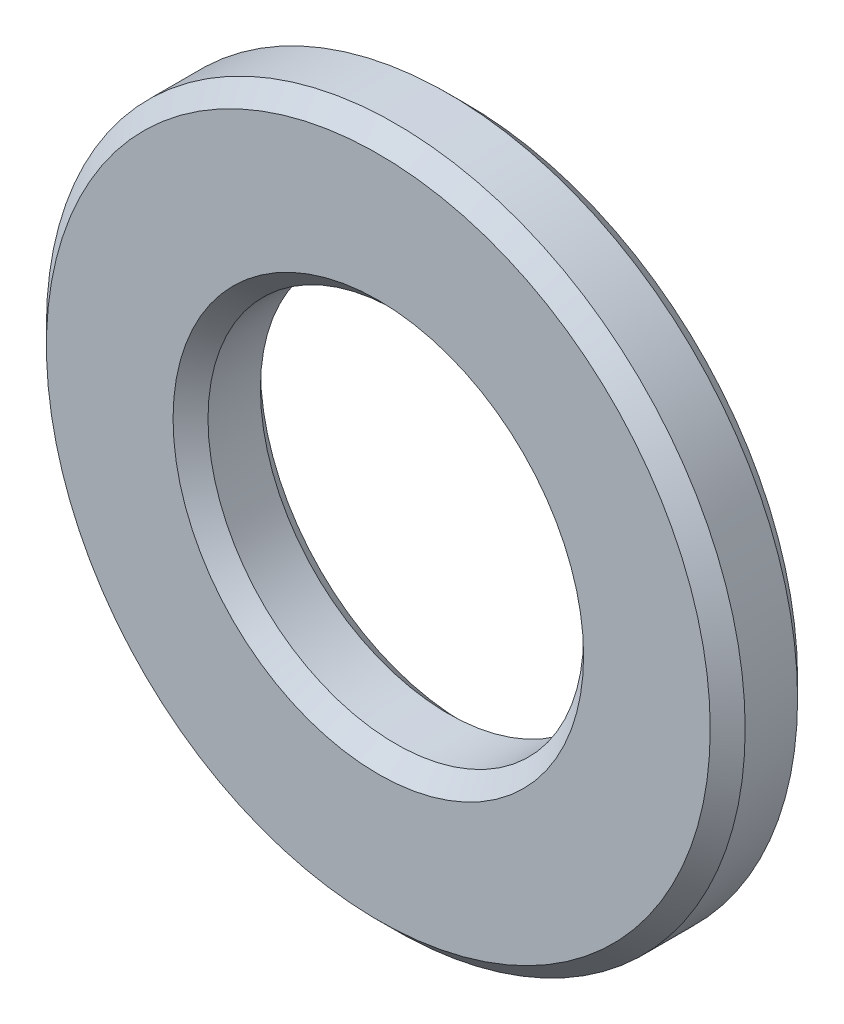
ISO-10303-21;
HEADER;
FILE_DESCRIPTION(('STEP AP214'),'2;1');
FILE_NAME('part.step','',(''),(''),'','','');
FILE_SCHEMA(('AUTOMOTIVE_DESIGN { 1 0 10303 214 1 1 1 1 }'));
ENDSEC;
DATA;
#1=APPLICATION_CONTEXT('core data for automotive mechanical design processes');
#2=APPLICATION_PROTOCOL_DEFINITION('international standard','automotive_design',2000,#1);
#3=PRODUCT_CONTEXT('',#1,'mechanical');
#4=PRODUCT('Part','Part','',(#3));
#5=PRODUCT_RELATED_PRODUCT_CATEGORY('part','',(#4));
#6=PRODUCT_DEFINITION_FORMATION('','',#4);
#7=PRODUCT_DEFINITION_CONTEXT('part definition',#1,'design');
#8=PRODUCT_DEFINITION('design','',#6,#7);
#9=PRODUCT_DEFINITION_SHAPE('','',#8);
#10=(LENGTH_UNIT() NAMED_UNIT(*) SI_UNIT(.MILLI.,.METRE.));
#11=(NAMED_UNIT(*) PLANE_ANGLE_UNIT() SI_UNIT($,.RADIAN.));
#12=(NAMED_UNIT(*) SI_UNIT($,.STERADIAN.) SOLID_ANGLE_UNIT());
#13=UNCERTAINTY_MEASURE_WITH_UNIT(LENGTH_MEASURE(1.E-05),#10,'distance_accuracy_value','');
#14=(GEOMETRIC_REPRESENTATION_CONTEXT(3) GLOBAL_UNCERTAINTY_ASSIGNED_CONTEXT((#13)) GLOBAL_UNIT_ASSIGNED_CONTEXT((#10,
#11,#12)) REPRESENTATION_CONTEXT('',''));
#15=CARTESIAN_POINT('',(0.,0.,0.));
#16=DIRECTION('',(0.,0.,1.));
#17=DIRECTION('',(1.,0.,0.));
#18=AXIS2_PLACEMENT_3D('',#15,#16,#17);
#19=CARTESIAN_POINT('',(0.,0.,0.5));
#20=DIRECTION('',(0.,0.,1.));
#21=DIRECTION('',(1.,0.,0.));
#22=AXIS2_PLACEMENT_3D('',#19,#20,#21);
#23=PLANE('',#22);
#24=CARTESIAN_POINT('',(0.,0.,0.5));
#25=DIRECTION('',(0.,0.,1.));
#26=DIRECTION('',(1.,0.,0.));
#27=AXIS2_PLACEMENT_3D('',#24,#25,#26);
#28=CIRCLE('',#27,2.35);
#29=CARTESIAN_POINT('',(2.35,0.,0.5));
#30=VERTEX_POINT('',#29);
#31=EDGE_CURVE('E10',#30,#30,#28,.F.);
#32=ORIENTED_EDGE('',*,*,#31,.T.);
#33=EDGE_LOOP('',(#32));
#34=FACE_BOUND('',#33,.T.);
#35=CARTESIAN_POINT('',(0.,0.,0.5));
#36=DIRECTION('',(0.,0.,1.));
#37=DIRECTION('',(1.,0.,0.));
#38=AXIS2_PLACEMENT_3D('',#35,#36,#37);
#39=CIRCLE('',#38,3.8);
#40=CARTESIAN_POINT('',(3.8,0.,0.5));
#41=VERTEX_POINT('',#40);
#42=EDGE_CURVE('E45',#41,#41,#39,.T.);
#43=ORIENTED_EDGE('',*,*,#42,.T.);
#44=EDGE_LOOP('',(#43));
#45=FACE_BOUND('',#44,.T.);
#46=ADVANCED_FACE('F37',(#34,#45),#23,.T.);
#47=CARTESIAN_POINT('',(0.,0.,-0.5));
#48=DIRECTION('',(0.,0.,1.));
#49=DIRECTION('',(1.,0.,0.));
#50=AXIS2_PLACEMENT_3D('',#47,#48,#49);
#51=PLANE('',#50);
#52=CARTESIAN_POINT('',(0.,0.,-0.5));
#53=DIRECTION('',(0.,0.,1.));
#54=DIRECTION('',(1.,0.,0.));
#55=AXIS2_PLACEMENT_3D('',#52,#53,#54);
#56=CIRCLE('',#55,3.8);
#57=CARTESIAN_POINT('',(3.8,0.,-0.5));
#58=VERTEX_POINT('',#57);
#59=EDGE_CURVE('E64',#58,#58,#56,.F.);
#60=ORIENTED_EDGE('',*,*,#59,.T.);
#61=EDGE_LOOP('',(#60));
#62=FACE_BOUND('',#61,.T.);
#63=CARTESIAN_POINT('',(0.,0.,-0.5));
#64=DIRECTION('',(0.,0.,1.));
#65=DIRECTION('',(1.,0.,0.));
#66=AXIS2_PLACEMENT_3D('',#63,#64,#65);
#67=CIRCLE('',#66,2.35);
#68=CARTESIAN_POINT('',(-2.35,0.,-0.5));
#69=VERTEX_POINT('',#68);
#70=EDGE_CURVE('E67',#69,#69,#67,.T.);
#71=ORIENTED_EDGE('',*,*,#70,.T.);
#72=EDGE_LOOP('',(#71));
#73=FACE_BOUND('',#72,.T.);
#74=ADVANCED_FACE('F89',(#62,#73),#51,.F.);
#75=CARTESIAN_POINT('',(0.,0.,0.5));
#76=DIRECTION('',(0.,0.,-1.));
#77=DIRECTION('',(-1.,0.,0.));
#78=AXIS2_PLACEMENT_3D('',#75,#76,#77);
#79=CYLINDRICAL_SURFACE('',#78,4.);
#80=CARTESIAN_POINT('',(0.,0.,-0.3));
#81=DIRECTION('',(0.,0.,1.));
#82=DIRECTION('',(1.,0.,0.));
#83=AXIS2_PLACEMENT_3D('',#80,#81,#82);
#84=CIRCLE('',#83,4.);
#85=CARTESIAN_POINT('',(4.,0.,-0.3));
#86=VERTEX_POINT('',#85);
#87=EDGE_CURVE('E70',#86,#86,#84,.T.);
#88=ORIENTED_EDGE('',*,*,#87,.T.);
#89=EDGE_LOOP('',(#88));
#90=FACE_BOUND('',#89,.T.);
#91=CARTESIAN_POINT('',(0.,0.,0.300000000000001));
#92=DIRECTION('',(0.,0.,1.));
#93=DIRECTION('',(1.,0.,0.));
#94=AXIS2_PLACEMENT_3D('',#91,#92,#93);
#95=CIRCLE('',#94,4.);
#96=CARTESIAN_POINT('',(4.,0.,0.300000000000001));
#97=VERTEX_POINT('',#96);
#98=EDGE_CURVE('E74',#97,#97,#95,.F.);
#99=ORIENTED_EDGE('',*,*,#98,.T.);
#100=EDGE_LOOP('',(#99));
#101=FACE_BOUND('',#100,.T.);
#102=ADVANCED_FACE('F78',(#90,#101),#79,.T.);
#103=CARTESIAN_POINT('',(0.,0.,0.5));
#104=DIRECTION('',(0.,0.,-1.));
#105=DIRECTION('',(-1.,0.,0.));
#106=AXIS2_PLACEMENT_3D('',#103,#104,#105);
#107=CYLINDRICAL_SURFACE('',#106,2.15);
#108=CARTESIAN_POINT('',(0.,0.,-0.300000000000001));
#109=DIRECTION('',(0.,0.,1.));
#110=DIRECTION('',(1.,0.,0.));
#111=AXIS2_PLACEMENT_3D('',#108,#109,#110);
#112=CIRCLE('',#111,2.15);
#113=CARTESIAN_POINT('',(-2.15,0.,-0.300000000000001));
#114=VERTEX_POINT('',#113);
#115=EDGE_CURVE('E52',#114,#114,#112,.F.);
#116=ORIENTED_EDGE('',*,*,#115,.T.);
#117=EDGE_LOOP('',(#116));
#118=FACE_BOUND('',#117,.T.);
#119=CARTESIAN_POINT('',(0.,0.,0.300000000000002));
#120=DIRECTION('',(0.,0.,1.));
#121=DIRECTION('',(1.,0.,0.));
#122=AXIS2_PLACEMENT_3D('',#119,#120,#121);
#123=CIRCLE('',#122,2.15);
#124=CARTESIAN_POINT('',(2.15,0.,0.300000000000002));
#125=VERTEX_POINT('',#124);
#126=EDGE_CURVE('E58',#125,#125,#123,.T.);
#127=ORIENTED_EDGE('',*,*,#126,.T.);
#128=EDGE_LOOP('',(#127));
#129=FACE_BOUND('',#128,.T.);
#130=ADVANCED_FACE('F97',(#118,#129),#107,.F.);
#131=CARTESIAN_POINT('',(0.,0.,-0.3));
#132=DIRECTION('',(0.,0.,1.));
#133=DIRECTION('',(1.,0.,0.));
#134=AXIS2_PLACEMENT_3D('',#131,#132,#133);
#135=CONICAL_SURFACE('',#134,4.,0.785398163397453);
#136=CARTESIAN_POINT('',(3.8,0.,-0.5));
#137=CARTESIAN_POINT('',(3.80208333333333,0.,-0.497916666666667));
#138=CARTESIAN_POINT('',(3.80416666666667,0.,-0.495833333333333));
#139=CARTESIAN_POINT('',(3.80833333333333,0.,-0.491666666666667));
#140=CARTESIAN_POINT('',(3.81041666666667,0.,-0.489583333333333));
#141=CARTESIAN_POINT('',(3.81458333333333,0.,-0.485416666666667));
#142=CARTESIAN_POINT('',(3.81666666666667,0.,-0.483333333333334));
#143=CARTESIAN_POINT('',(3.82083333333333,0.,-0.479166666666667));
#144=CARTESIAN_POINT('',(3.82291666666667,0.,-0.477083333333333));
#145=CARTESIAN_POINT('',(3.82708333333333,0.,-0.472916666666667));
#146=CARTESIAN_POINT('',(3.82916666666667,0.,-0.470833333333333));
#147=CARTESIAN_POINT('',(3.83333333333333,0.,-0.466666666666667));
#148=CARTESIAN_POINT('',(3.83541666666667,0.,-0.464583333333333));
#149=CARTESIAN_POINT('',(3.83958333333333,0.,-0.460416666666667));
#150=CARTESIAN_POINT('',(3.84166666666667,0.,-0.458333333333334));
#151=CARTESIAN_POINT('',(3.84583333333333,0.,-0.454166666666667));
#152=CARTESIAN_POINT('',(3.84791666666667,0.,-0.452083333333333));
#153=CARTESIAN_POINT('',(3.85208333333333,0.,-0.447916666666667));
#154=CARTESIAN_POINT('',(3.85416666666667,0.,-0.445833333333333));
#155=CARTESIAN_POINT('',(3.85833333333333,0.,-0.441666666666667));
#156=CARTESIAN_POINT('',(3.86041666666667,0.,-0.439583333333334));
#157=CARTESIAN_POINT('',(3.86458333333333,0.,-0.435416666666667));
#158=CARTESIAN_POINT('',(3.86666666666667,0.,-0.433333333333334));
#159=CARTESIAN_POINT('',(3.87083333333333,0.,-0.429166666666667));
#160=CARTESIAN_POINT('',(3.87291666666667,0.,-0.427083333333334));
#161=CARTESIAN_POINT('',(3.87708333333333,0.,-0.422916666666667));
#162=CARTESIAN_POINT('',(3.87916666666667,0.,-0.420833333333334));
#163=CARTESIAN_POINT('',(3.88333333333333,0.,-0.416666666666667));
#164=CARTESIAN_POINT('',(3.88541666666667,0.,-0.414583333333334));
#165=CARTESIAN_POINT('',(3.88958333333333,0.,-0.410416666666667));
#166=CARTESIAN_POINT('',(3.89166666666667,0.,-0.408333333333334));
#167=CARTESIAN_POINT('',(3.89583333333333,0.,-0.404166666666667));
#168=CARTESIAN_POINT('',(3.89791666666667,0.,-0.402083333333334));
#169=CARTESIAN_POINT('',(3.90208333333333,0.,-0.397916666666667));
#170=CARTESIAN_POINT('',(3.90416666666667,0.,-0.395833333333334));
#171=CARTESIAN_POINT('',(3.90833333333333,0.,-0.391666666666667));
#172=CARTESIAN_POINT('',(3.91041666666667,0.,-0.389583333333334));
#173=CARTESIAN_POINT('',(3.91458333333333,0.,-0.385416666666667));
#174=CARTESIAN_POINT('',(3.91666666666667,0.,-0.383333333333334));
#175=CARTESIAN_POINT('',(3.92083333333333,0.,-0.379166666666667));
#176=CARTESIAN_POINT('',(3.92291666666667,0.,-0.377083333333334));
#177=CARTESIAN_POINT('',(3.92708333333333,0.,-0.372916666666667));
#178=CARTESIAN_POINT('',(3.92916666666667,0.,-0.370833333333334));
#179=CARTESIAN_POINT('',(3.93333333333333,0.,-0.366666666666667));
#180=CARTESIAN_POINT('',(3.93541666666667,0.,-0.364583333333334));
#181=CARTESIAN_POINT('',(3.93958333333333,0.,-0.360416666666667));
#182=CARTESIAN_POINT('',(3.94166666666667,0.,-0.358333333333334));
#183=CARTESIAN_POINT('',(3.94583333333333,0.,-0.354166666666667));
#184=CARTESIAN_POINT('',(3.94791666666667,0.,-0.352083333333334));
#185=CARTESIAN_POINT('',(3.95208333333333,0.,-0.347916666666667));
#186=CARTESIAN_POINT('',(3.95416666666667,0.,-0.345833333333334));
#187=CARTESIAN_POINT('',(3.95833333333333,0.,-0.341666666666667));
#188=CARTESIAN_POINT('',(3.96041666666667,0.,-0.339583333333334));
#189=CARTESIAN_POINT('',(3.96458333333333,0.,-0.335416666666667));
#190=CARTESIAN_POINT('',(3.96666666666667,0.,-0.333333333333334));
#191=CARTESIAN_POINT('',(3.97083333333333,0.,-0.329166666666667));
#192=CARTESIAN_POINT('',(3.97291666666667,0.,-0.327083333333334));
#193=CARTESIAN_POINT('',(3.97708333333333,0.,-0.322916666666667));
#194=CARTESIAN_POINT('',(3.97916666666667,0.,-0.320833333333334));
#195=CARTESIAN_POINT('',(3.98333333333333,0.,-0.316666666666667));
#196=CARTESIAN_POINT('',(3.98541666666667,0.,-0.314583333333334));
#197=CARTESIAN_POINT('',(3.98958333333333,0.,-0.310416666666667));
#198=CARTESIAN_POINT('',(3.99166666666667,0.,-0.308333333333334));
#199=CARTESIAN_POINT('',(3.99583333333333,0.,-0.304166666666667));
#200=CARTESIAN_POINT('',(3.99791666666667,0.,-0.302083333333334));
#201=CARTESIAN_POINT('',(4.,0.,-0.3));
#202=B_SPLINE_CURVE_WITH_KNOTS('',3,(#136,#137,#138,#139,#140,#141,#142,#143,#144,#145,#146,
#147,#148,#149,#150,#151,#152,#153,#154,#155,#156,#157,#158,#159,#160,#161,#162,#163,#164,#165,
#166,#167,#168,#169,#170,#171,#172,#173,#174,#175,#176,#177,#178,#179,#180,#181,#182,#183,#184,
#185,#186,#187,#188,#189,#190,#191,#192,#193,#194,#195,#196,#197,#198,#199,#200,#201),
.UNSPECIFIED.,.F.,.F.,(4,2,2,2,2,2,2,2,2,2,2,2,2,2,2,2,2,2,2,2,2,2,2,2,2,2,2,2,2,2,2,2,4),(0.,
0.00883883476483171,0.0176776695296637,0.0265165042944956,0.0353553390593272,0.0441941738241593,
0.0530330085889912,0.0618718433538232,0.0707106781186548,0.0795495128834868,0.0883883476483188,
0.0972271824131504,0.106066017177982,0.114904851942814,0.123743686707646,0.132582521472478,
0.14142135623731,0.150260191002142,0.159099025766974,0.167937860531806,0.176776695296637,
0.185615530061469,0.194454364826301,0.203293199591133,0.212132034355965,0.220970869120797,
0.229809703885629,0.238648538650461,0.247487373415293,0.256326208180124,0.265165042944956,
0.274003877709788,0.28284271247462),.UNSPECIFIED.);
#203=EDGE_CURVE('BSEAM102',#58,#86,#202,.T.);
#204=ORIENTED_EDGE('',*,*,#59,.F.);
#205=ORIENTED_EDGE('',*,*,#87,.F.);
#206=ORIENTED_EDGE('',*,*,#203,.T.);
#207=ORIENTED_EDGE('',*,*,#203,.F.);
#208=EDGE_LOOP('',(#204,#206,#205,#207));
#209=FACE_BOUND('',#208,.T.);
#210=ADVANCED_FACE('F102',(#209),#135,.T.);
#211=CARTESIAN_POINT('',(0.,0.,-0.5));
#212=DIRECTION('',(0.,0.,-1.));
#213=DIRECTION('',(-1.,0.,0.));
#214=AXIS2_PLACEMENT_3D('',#211,#212,#213);
#215=CONICAL_SURFACE('',#214,2.35,0.785398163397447);
#216=CARTESIAN_POINT('',(-2.15,0.,-0.300000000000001));
#217=CARTESIAN_POINT('',(-2.15208333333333,0.,-0.302083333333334));
#218=CARTESIAN_POINT('',(-2.15416666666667,0.,-0.304166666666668));
#219=CARTESIAN_POINT('',(-2.15833333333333,0.,-0.308333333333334));
#220=CARTESIAN_POINT('',(-2.16041666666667,0.,-0.310416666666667));
#221=CARTESIAN_POINT('',(-2.16458333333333,0.,-0.314583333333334));
#222=CARTESIAN_POINT('',(-2.16666666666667,0.,-0.316666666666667));
#223=CARTESIAN_POINT('',(-2.17083333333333,0.,-0.320833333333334));
#224=CARTESIAN_POINT('',(-2.17291666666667,0.,-0.322916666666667));
#225=CARTESIAN_POINT('',(-2.17708333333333,0.,-0.327083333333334));
#226=CARTESIAN_POINT('',(-2.17916666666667,0.,-0.329166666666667));
#227=CARTESIAN_POINT('',(-2.18333333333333,0.,-0.333333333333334));
#228=CARTESIAN_POINT('',(-2.18541666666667,0.,-0.335416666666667));
#229=CARTESIAN_POINT('',(-2.18958333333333,0.,-0.339583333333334));
#230=CARTESIAN_POINT('',(-2.19166666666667,0.,-0.341666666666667));
#231=CARTESIAN_POINT('',(-2.19583333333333,0.,-0.345833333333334));
#232=CARTESIAN_POINT('',(-2.19791666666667,0.,-0.347916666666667));
#233=CARTESIAN_POINT('',(-2.20208333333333,0.,-0.352083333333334));
#234=CARTESIAN_POINT('',(-2.20416666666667,0.,-0.354166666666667));
#235=CARTESIAN_POINT('',(-2.20833333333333,0.,-0.358333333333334));
#236=CARTESIAN_POINT('',(-2.21041666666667,0.,-0.360416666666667));
#237=CARTESIAN_POINT('',(-2.21458333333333,0.,-0.364583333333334));
#238=CARTESIAN_POINT('',(-2.21666666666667,0.,-0.366666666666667));
#239=CARTESIAN_POINT('',(-2.22083333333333,0.,-0.370833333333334));
#240=CARTESIAN_POINT('',(-2.22291666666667,0.,-0.372916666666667));
#241=CARTESIAN_POINT('',(-2.22708333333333,0.,-0.377083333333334));
#242=CARTESIAN_POINT('',(-2.22916666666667,0.,-0.379166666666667));
#243=CARTESIAN_POINT('',(-2.23333333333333,0.,-0.383333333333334));
#244=CARTESIAN_POINT('',(-2.23541666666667,0.,-0.385416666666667));
#245=CARTESIAN_POINT('',(-2.23958333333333,0.,-0.389583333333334));
#246=CARTESIAN_POINT('',(-2.24166666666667,0.,-0.391666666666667));
#247=CARTESIAN_POINT('',(-2.24583333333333,0.,-0.395833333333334));
#248=CARTESIAN_POINT('',(-2.24791666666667,0.,-0.397916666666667));
#249=CARTESIAN_POINT('',(-2.25208333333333,0.,-0.402083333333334));
#250=CARTESIAN_POINT('',(-2.25416666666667,0.,-0.404166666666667));
#251=CARTESIAN_POINT('',(-2.25833333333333,0.,-0.408333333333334));
#252=CARTESIAN_POINT('',(-2.26041666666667,0.,-0.410416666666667));
#253=CARTESIAN_POINT('',(-2.26458333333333,0.,-0.414583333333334));
#254=CARTESIAN_POINT('',(-2.26666666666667,0.,-0.416666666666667));
#255=CARTESIAN_POINT('',(-2.27083333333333,0.,-0.420833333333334));
#256=CARTESIAN_POINT('',(-2.27291666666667,0.,-0.422916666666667));
#257=CARTESIAN_POINT('',(-2.27708333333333,0.,-0.427083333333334));
#258=CARTESIAN_POINT('',(-2.27916666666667,0.,-0.429166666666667));
#259=CARTESIAN_POINT('',(-2.28333333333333,0.,-0.433333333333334));
#260=CARTESIAN_POINT('',(-2.28541666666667,0.,-0.435416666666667));
#261=CARTESIAN_POINT('',(-2.28958333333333,0.,-0.439583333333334));
#262=CARTESIAN_POINT('',(-2.29166666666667,0.,-0.441666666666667));
#263=CARTESIAN_POINT('',(-2.29583333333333,0.,-0.445833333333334));
#264=CARTESIAN_POINT('',(-2.29791666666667,0.,-0.447916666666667));
#265=CARTESIAN_POINT('',(-2.30208333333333,0.,-0.452083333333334));
#266=CARTESIAN_POINT('',(-2.30416666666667,0.,-0.454166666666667));
#267=CARTESIAN_POINT('',(-2.30833333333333,0.,-0.458333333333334));
#268=CARTESIAN_POINT('',(-2.31041666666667,0.,-0.460416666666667));
#269=CARTESIAN_POINT('',(-2.31458333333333,0.,-0.464583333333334));
#270=CARTESIAN_POINT('',(-2.31666666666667,0.,-0.466666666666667));
#271=CARTESIAN_POINT('',(-2.32083333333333,0.,-0.470833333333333));
#272=CARTESIAN_POINT('',(-2.32291666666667,0.,-0.472916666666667));
#273=CARTESIAN_POINT('',(-2.32708333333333,0.,-0.477083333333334));
#274=CARTESIAN_POINT('',(-2.32916666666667,0.,-0.479166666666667));
#275=CARTESIAN_POINT('',(-2.33333333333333,0.,-0.483333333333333));
#276=CARTESIAN_POINT('',(-2.33541666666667,0.,-0.485416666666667));
#277=CARTESIAN_POINT('',(-2.33958333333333,0.,-0.489583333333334));
#278=CARTESIAN_POINT('',(-2.34166666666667,0.,-0.491666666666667));
#279=CARTESIAN_POINT('',(-2.34583333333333,0.,-0.495833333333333));
#280=CARTESIAN_POINT('',(-2.34791666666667,0.,-0.497916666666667));
#281=CARTESIAN_POINT('',(-2.35,0.,-0.5));
#282=B_SPLINE_CURVE_WITH_KNOTS('',3,(#216,#217,#218,#219,#220,#221,#222,#223,#224,#225,#226,
#227,#228,#229,#230,#231,#232,#233,#234,#235,#236,#237,#238,#239,#240,#241,#242,#243,#244,#245,
#246,#247,#248,#249,#250,#251,#252,#253,#254,#255,#256,#257,#258,#259,#260,#261,#262,#263,#264,
#265,#266,#267,#268,#269,#270,#271,#272,#273,#274,#275,#276,#277,#278,#279,#280,#281),
.UNSPECIFIED.,.F.,.F.,(4,2,2,2,2,2,2,2,2,2,2,2,2,2,2,2,2,2,2,2,2,2,2,2,2,2,2,2,2,2,2,2,4),(0.,
0.00883883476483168,0.0176776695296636,0.0265165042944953,0.0353553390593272,0.0441941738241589,
0.0530330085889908,0.0618718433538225,0.0707106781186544,0.0795495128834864,0.0883883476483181,
0.0972271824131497,0.106066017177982,0.114904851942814,0.123743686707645,0.132582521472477,
0.141421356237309,0.150260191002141,0.159099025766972,0.167937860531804,0.176776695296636,
0.185615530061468,0.1944543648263,0.203293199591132,0.212132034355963,0.220970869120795,
0.229809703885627,0.238648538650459,0.24748737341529,0.256326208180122,0.265165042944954,
0.274003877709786,0.282842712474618),.UNSPECIFIED.);
#283=EDGE_CURVE('BSEAM86',#114,#69,#282,.T.);
#284=ORIENTED_EDGE('',*,*,#115,.F.);
#285=ORIENTED_EDGE('',*,*,#70,.F.);
#286=ORIENTED_EDGE('',*,*,#283,.T.);
#287=ORIENTED_EDGE('',*,*,#283,.F.);
#288=EDGE_LOOP('',(#284,#286,#285,#287));
#289=FACE_BOUND('',#288,.T.);
#290=ADVANCED_FACE('F86',(#289),#215,.F.);
#291=CARTESIAN_POINT('',(0.,0.,0.300000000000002));
#292=DIRECTION('',(0.,0.,1.));
#293=DIRECTION('',(1.,0.,0.));
#294=AXIS2_PLACEMENT_3D('',#291,#292,#293);
#295=CONICAL_SURFACE('',#294,2.15,0.785398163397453);
#296=ORIENTED_EDGE('',*,*,#31,.F.);
#297=EDGE_LOOP('',(#296));
#298=FACE_BOUND('',#297,.T.);
#299=ORIENTED_EDGE('',*,*,#126,.F.);
#300=EDGE_LOOP('',(#299));
#301=FACE_BOUND('',#300,.T.);
#302=ADVANCED_FACE('F82',(#298,#301),#295,.F.);
#303=CARTESIAN_POINT('',(0.,0.,0.5));
#304=DIRECTION('',(0.,0.,-1.));
#305=DIRECTION('',(-1.,0.,0.));
#306=AXIS2_PLACEMENT_3D('',#303,#304,#305);
#307=CONICAL_SURFACE('',#306,3.8,0.785398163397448);
#308=ORIENTED_EDGE('',*,*,#98,.F.);
#309=EDGE_LOOP('',(#308));
#310=FACE_BOUND('',#309,.T.);
#311=ORIENTED_EDGE('',*,*,#42,.F.);
#312=EDGE_LOOP('',(#311));
#313=FACE_BOUND('',#312,.T.);
#314=ADVANCED_FACE('F39',(#310,#313),#307,.T.);
#315=CLOSED_SHELL('',(#46,#74,#102,#130,#210,#290,#302,#314));
#316=MANIFOLD_SOLID_BREP('B2',#315);
#317=ADVANCED_BREP_SHAPE_REPRESENTATION('',(#18,#316),#14);
#318=SHAPE_DEFINITION_REPRESENTATION(#9,#317);
ENDSEC;
END-ISO-10303-21;
